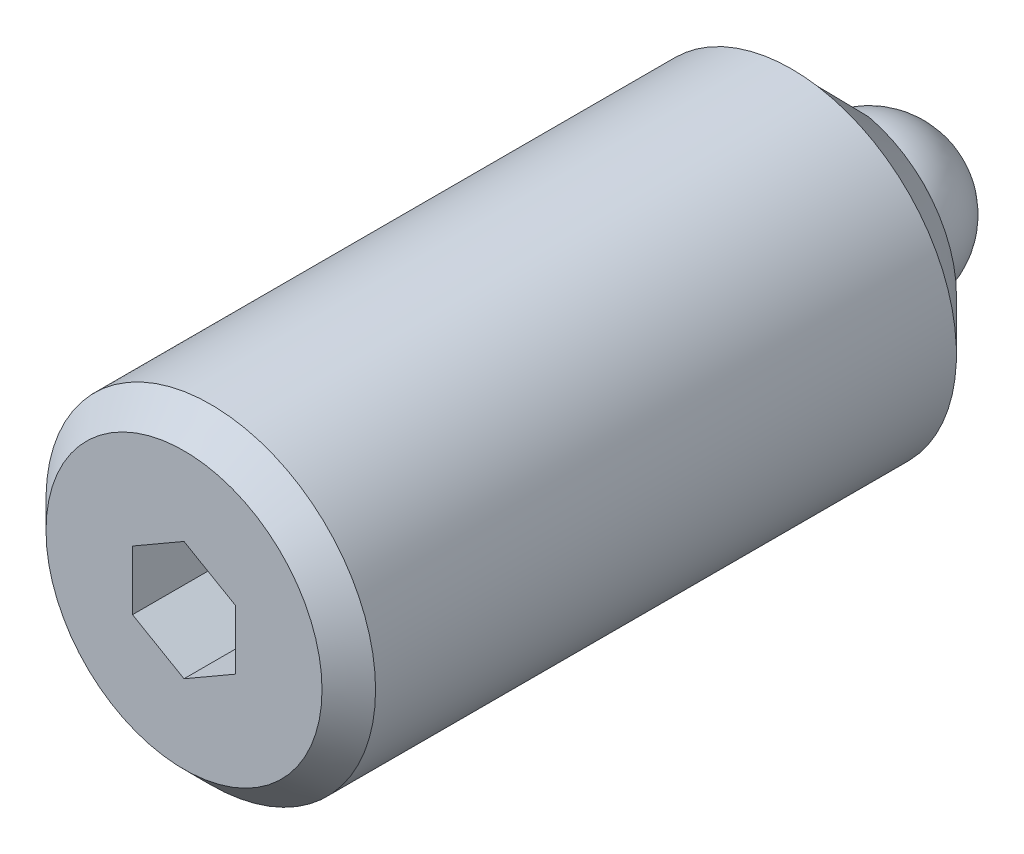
ISO-10303-21;
HEADER;
FILE_DESCRIPTION(('STEP AP214'),'2;1');
FILE_NAME('part.step','',(''),(''),'','','');
FILE_SCHEMA(('AUTOMOTIVE_DESIGN { 1 0 10303 214 1 1 1 1 }'));
ENDSEC;
DATA;
#1=APPLICATION_CONTEXT('core data for automotive mechanical design processes');
#2=APPLICATION_PROTOCOL_DEFINITION('international standard','automotive_design',2000,#1);
#3=PRODUCT_CONTEXT('',#1,'mechanical');
#4=PRODUCT('Part','Part','',(#3));
#5=PRODUCT_RELATED_PRODUCT_CATEGORY('part','',(#4));
#6=PRODUCT_DEFINITION_FORMATION('','',#4);
#7=PRODUCT_DEFINITION_CONTEXT('part definition',#1,'design');
#8=PRODUCT_DEFINITION('design','',#6,#7);
#9=PRODUCT_DEFINITION_SHAPE('','',#8);
#10=(LENGTH_UNIT() NAMED_UNIT(*) SI_UNIT(.MILLI.,.METRE.));
#11=(NAMED_UNIT(*) PLANE_ANGLE_UNIT() SI_UNIT($,.RADIAN.));
#12=(NAMED_UNIT(*) SI_UNIT($,.STERADIAN.) SOLID_ANGLE_UNIT());
#13=UNCERTAINTY_MEASURE_WITH_UNIT(LENGTH_MEASURE(1.E-05),#10,'distance_accuracy_value','');
#14=(GEOMETRIC_REPRESENTATION_CONTEXT(3) GLOBAL_UNCERTAINTY_ASSIGNED_CONTEXT((#13)) GLOBAL_UNIT_ASSIGNED_CONTEXT((#10,
#11,#12)) REPRESENTATION_CONTEXT('',''));
#15=CARTESIAN_POINT('',(0.,0.,0.));
#16=DIRECTION('',(0.,0.,1.));
#17=DIRECTION('',(1.,0.,0.));
#18=AXIS2_PLACEMENT_3D('',#15,#16,#17);
#19=CARTESIAN_POINT('',(0.,3.75,5.));
#20=DIRECTION('',(0.,0.,-1.));
#21=DIRECTION('',(-1.,0.,0.));
#22=AXIS2_PLACEMENT_3D('',#19,#20,#21);
#23=PLANE('',#22);
#24=DIRECTION('',(0.,-1.,0.));
#25=VECTOR('',#24,1.);
#26=CARTESIAN_POINT('',(1.25,-3.53553390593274,5.));
#27=LINE('',#26,#25);
#28=CARTESIAN_POINT('',(1.25,-3.53553390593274,5.));
#29=VERTEX_POINT('',#28);
#30=CARTESIAN_POINT('',(1.25,-5.35607132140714,5.));
#31=VERTEX_POINT('',#30);
#32=EDGE_CURVE('E130',#29,#31,#27,.T.);
#33=ORIENTED_EDGE('',*,*,#32,.F.);
#34=CARTESIAN_POINT('',(0.,0.,5.));
#35=DIRECTION('',(0.,0.,-1.));
#36=DIRECTION('',(-1.,0.,0.));
#37=AXIS2_PLACEMENT_3D('',#34,#35,#36);
#38=CIRCLE('',#37,3.75);
#39=CARTESIAN_POINT('',(1.25,3.53553390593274,5.));
#40=VERTEX_POINT('',#39);
#41=EDGE_CURVE('E219',#40,#29,#38,.T.);
#42=ORIENTED_EDGE('',*,*,#41,.F.);
#43=DIRECTION('',(0.,-1.,0.));
#44=VECTOR('',#43,1.);
#45=CARTESIAN_POINT('',(1.25,8.88295940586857,5.));
#46=LINE('',#45,#44);
#47=CARTESIAN_POINT('',(1.25,5.35607132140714,5.));
#48=VERTEX_POINT('',#47);
#49=EDGE_CURVE('E149',#48,#40,#46,.T.);
#50=ORIENTED_EDGE('',*,*,#49,.F.);
#51=CARTESIAN_POINT('',(0.,0.,5.));
#52=DIRECTION('',(0.,0.,-1.));
#53=DIRECTION('',(-1.,0.,0.));
#54=AXIS2_PLACEMENT_3D('',#51,#52,#53);
#55=CIRCLE('',#54,5.5);
#56=EDGE_CURVE('E228',#48,#31,#55,.T.);
#57=ORIENTED_EDGE('',*,*,#56,.T.);
#58=EDGE_LOOP('',(#33,#42,#50,#57));
#59=FACE_BOUND('',#58,.T.);
#60=ADVANCED_FACE('F14',(#59),#23,.T.);
#61=CARTESIAN_POINT('',(0.,0.,5.));
#62=DIRECTION('',(0.,0.,1.));
#63=DIRECTION('',(1.,0.,0.));
#64=AXIS2_PLACEMENT_3D('',#61,#62,#63);
#65=CONICAL_SURFACE('',#64,5.5,0.785398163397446);
#66=CARTESIAN_POINT('',(1.25,-0.636175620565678,0.902575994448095));
#67=CARTESIAN_POINT('',(1.25,-0.687765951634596,0.92601692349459));
#68=CARTESIAN_POINT('',(1.25,-0.738489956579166,0.951245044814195));
#69=CARTESIAN_POINT('',(1.25,-0.838371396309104,1.00451066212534));
#70=CARTESIAN_POINT('',(1.25,-0.887530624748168,1.03254477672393));
#71=CARTESIAN_POINT('',(1.25,-0.984401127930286,1.09061522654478));
#72=CARTESIAN_POINT('',(1.25,-1.03211685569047,1.12064423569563));
#73=CARTESIAN_POINT('',(1.25,-1.12650286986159,1.18233004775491));
#74=CARTESIAN_POINT('',(1.25,-1.17317279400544,1.21398740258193));
#75=CARTESIAN_POINT('',(1.25,-1.31143515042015,1.31052309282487));
#76=CARTESIAN_POINT('',(1.25,-1.40173495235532,1.37724748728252));
#77=CARTESIAN_POINT('',(1.25,-1.58002053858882,1.51387906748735));
#78=CARTESIAN_POINT('',(1.25,-1.66800357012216,1.58378979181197));
#79=CARTESIAN_POINT('',(1.25,-1.84105213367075,1.72474492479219));
#80=CARTESIAN_POINT('',(1.25,-1.92614113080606,1.79576062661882));
#81=CARTESIAN_POINT('',(1.25,-2.09508757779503,1.93924521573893));
#82=CARTESIAN_POINT('',(1.25,-2.17894495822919,2.01171418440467));
#83=CARTESIAN_POINT('',(1.25,-2.42917197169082,2.23071304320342));
#84=CARTESIAN_POINT('',(1.25,-2.59416714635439,2.37881048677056));
#85=CARTESIAN_POINT('',(1.25,-2.92196473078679,2.67740209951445));
#86=CARTESIAN_POINT('',(1.25,-3.08476708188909,2.82789633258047));
#87=CARTESIAN_POINT('',(1.25,-3.40891855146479,3.13040468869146));
#88=CARTESIAN_POINT('',(1.25,-3.57026782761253,3.28241864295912));
#89=CARTESIAN_POINT('',(1.25,-3.89271642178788,3.58816799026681));
#90=CARTESIAN_POINT('',(1.25,-4.05381129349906,3.74190806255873));
#91=CARTESIAN_POINT('',(1.25,-4.37529925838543,4.05012837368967));
#92=CARTESIAN_POINT('',(1.25,-4.5356923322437,4.2046086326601));
#93=CARTESIAN_POINT('',(1.25,-5.01605406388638,4.66879460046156));
#94=CARTESIAN_POINT('',(1.25,-5.33525577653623,4.97929370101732));
#95=CARTESIAN_POINT('',(1.25,-5.73904884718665,5.37357317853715));
#96=CARTESIAN_POINT('',(1.25,-5.82418979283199,5.45679264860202));
#97=CARTESIAN_POINT('',(1.25,-5.99431257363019,5.62323211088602));
#98=CARTESIAN_POINT('',(1.25,-6.07929448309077,5.7064520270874));
#99=CARTESIAN_POINT('',(1.25,-6.60154035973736,6.21827540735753));
#100=CARTESIAN_POINT('',(1.25,-7.03796289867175,6.64773729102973));
#101=CARTESIAN_POINT('',(1.25,-7.90982021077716,7.50766504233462));
#102=CARTESIAN_POINT('',(1.25,-8.34525497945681,7.93813091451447));
#103=CARTESIAN_POINT('',(1.25,-9.21804269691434,8.8022023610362));
#104=CARTESIAN_POINT('',(1.25,-9.65539201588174,9.23581160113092));
#105=CARTESIAN_POINT('',(1.25,-10.5296541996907,10.103462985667));
#106=CARTESIAN_POINT('',(1.25,-10.9665670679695,10.5375051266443));
#107=CARTESIAN_POINT('',(1.25,-11.403360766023,10.9716666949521));
#108=B_SPLINE_CURVE_WITH_KNOTS('',3,(#66,#67,#68,#69,#70,#71,#72,#73,#74,#75,#76,#77,#78,#79,
#80,#81,#82,#83,#84,#85,#86,#87,#88,#89,#90,#91,#92,#93,#94,#95,#96,#97,#98,#99,#100,#101,#102,
#103,#104,#105,#106,#107),.UNSPECIFIED.,.F.,.F.,(4,2,2,2,2,2,2,2,2,2,2,2,2,2,2,2,2,2,2,2,4),(0.,
0.169892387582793,0.339582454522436,0.5086805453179,0.677836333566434,1.01454437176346,
1.35163591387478,1.68410335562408,2.01658946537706,2.68167610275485,3.34678049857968,
4.01181183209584,4.67985691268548,5.34792026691,6.68383745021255,7.04100715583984,
7.39783661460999,9.2347105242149,11.0715927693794,12.9191915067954,14.7667755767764),.UNSPECIFIED.);
#109=CARTESIAN_POINT('',(1.25,-7.90174031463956,7.5));
#110=VERTEX_POINT('',#109);
#111=EDGE_CURVE('E9',#31,#110,#108,.T.);
#112=ORIENTED_EDGE('',*,*,#111,.F.);
#113=ORIENTED_EDGE('',*,*,#56,.F.);
#114=CARTESIAN_POINT('',(1.25,10.372012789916,9.94706414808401));
#115=CARTESIAN_POINT('',(1.25,9.97486132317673,9.55280019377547));
#116=CARTESIAN_POINT('',(1.25,9.57757942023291,9.1586670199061));
#117=CARTESIAN_POINT('',(1.25,8.78256551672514,8.37090183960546));
#118=CARTESIAN_POINT('',(1.25,8.38483354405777,7.9772698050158));
#119=CARTESIAN_POINT('',(1.25,7.58879350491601,7.19080865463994));
#120=CARTESIAN_POINT('',(1.25,7.1904856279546,6.79797934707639));
#121=CARTESIAN_POINT('',(1.25,6.39275328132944,6.01340650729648));
#122=CARTESIAN_POINT('',(1.25,5.99332874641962,5.62166304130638));
#123=CARTESIAN_POINT('',(1.25,5.4309374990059,5.07282441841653));
#124=CARTESIAN_POINT('',(1.25,5.26878371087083,4.91489651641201));
#125=CARTESIAN_POINT('',(1.25,4.94405474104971,4.59947789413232));
#126=CARTESIAN_POINT('',(1.25,4.78147956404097,4.44198716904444));
#127=CARTESIAN_POINT('',(1.25,4.45579189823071,4.12760969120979));
#128=CARTESIAN_POINT('',(1.25,4.29267949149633,3.97072285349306));
#129=CARTESIAN_POINT('',(1.25,3.96567849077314,3.65774610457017));
#130=CARTESIAN_POINT('',(1.25,3.80178986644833,3.50165622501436));
#131=CARTESIAN_POINT('',(1.25,3.47283655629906,3.19055994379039));
#132=CARTESIAN_POINT('',(1.25,3.30777134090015,3.03555410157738));
#133=CARTESIAN_POINT('',(1.25,2.97603308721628,2.72730018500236));
#134=CARTESIAN_POINT('',(1.25,2.80936022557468,2.57405192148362));
#135=CARTESIAN_POINT('',(1.25,2.55736222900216,2.34628380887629));
#136=CARTESIAN_POINT('',(1.25,2.47300785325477,2.27069121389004));
#137=CARTESIAN_POINT('',(1.25,2.30345394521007,2.12046703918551));
#138=CARTESIAN_POINT('',(1.25,2.21825445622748,2.04583541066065));
#139=CARTESIAN_POINT('',(1.25,2.04670450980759,1.89783478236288));
#140=CARTESIAN_POINT('',(1.25,1.96035362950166,1.82446627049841));
#141=CARTESIAN_POINT('',(1.25,1.82968211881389,1.71577400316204));
#142=CARTESIAN_POINT('',(1.25,1.78593024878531,1.67976694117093));
#143=CARTESIAN_POINT('',(1.25,1.69797281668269,1.60830728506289));
#144=CARTESIAN_POINT('',(1.25,1.6537672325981,1.57285471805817));
#145=CARTESIAN_POINT('',(1.25,1.60929974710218,1.53773052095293));
#146=B_SPLINE_CURVE_WITH_KNOTS('',3,(#114,#115,#116,#117,#118,#119,#120,#121,#122,#123,#124,
#125,#126,#127,#128,#129,#130,#131,#132,#133,#134,#135,#136,#137,#138,#139,#140,#141,#142,#143,
#144,#145),.UNSPECIFIED.,.F.,.F.,(4,2,2,2,2,2,2,2,2,2,2,2,2,2,2,4),(0.,1.67885747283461,
3.35761603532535,5.03591081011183,6.71430578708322,7.39336017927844,8.07240706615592,
8.75135463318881,9.43032895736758,10.109631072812,10.7888593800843,11.1286614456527,
11.4684461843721,11.8083593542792,11.9783453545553,12.1483396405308),.UNSPECIFIED.);
#147=CARTESIAN_POINT('',(1.25,7.90174031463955,7.5));
#148=VERTEX_POINT('',#147);
#149=EDGE_CURVE('E243',#148,#48,#146,.T.);
#150=ORIENTED_EDGE('',*,*,#149,.F.);
#151=CARTESIAN_POINT('',(0.,0.,7.5));
#152=DIRECTION('',(0.,0.,-1.));
#153=DIRECTION('',(-1.,0.,0.));
#154=AXIS2_PLACEMENT_3D('',#151,#152,#153);
#155=CIRCLE('',#154,8.);
#156=EDGE_CURVE('E231',#110,#148,#155,.F.);
#157=ORIENTED_EDGE('',*,*,#156,.F.);
#158=EDGE_LOOP('',(#112,#113,#150,#157));
#159=FACE_BOUND('',#158,.T.);
#160=ADVANCED_FACE('F304',(#159),#65,.T.);
#161=CARTESIAN_POINT('',(0.,8.,37.));
#162=DIRECTION('',(0.,0.,1.));
#163=DIRECTION('',(1.,0.,0.));
#164=AXIS2_PLACEMENT_3D('',#161,#162,#163);
#165=PLANE('',#164);
#166=CARTESIAN_POINT('',(0.,0.,37.));
#167=DIRECTION('',(0.,0.,1.));
#168=DIRECTION('',(1.,0.,0.));
#169=AXIS2_PLACEMENT_3D('',#166,#167,#168);
#170=CIRCLE('',#169,6.7);
#171=CARTESIAN_POINT('',(6.7,0.,37.));
#172=VERTEX_POINT('',#171);
#173=EDGE_CURVE('E224',#172,#172,#170,.T.);
#174=ORIENTED_EDGE('',*,*,#173,.T.);
#175=EDGE_LOOP('',(#174));
#176=FACE_BOUND('',#175,.T.);
#177=DIRECTION('',(0.866025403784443,-0.499999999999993,0.));
#178=VECTOR('',#177,1.);
#179=CARTESIAN_POINT('',(-2.5,-1.44337567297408,37.));
#180=LINE('',#179,#178);
#181=CARTESIAN_POINT('',(-2.5,-1.44337567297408,37.));
#182=VERTEX_POINT('',#181);
#183=CARTESIAN_POINT('',(0.,-2.88675134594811,37.));
#184=VERTEX_POINT('',#183);
#185=EDGE_CURVE('E181',#182,#184,#180,.T.);
#186=ORIENTED_EDGE('',*,*,#185,.F.);
#187=DIRECTION('',(0.,1.,0.));
#188=VECTOR('',#187,1.);
#189=CARTESIAN_POINT('',(-2.5,-1.44337567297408,37.));
#190=LINE('',#189,#188);
#191=CARTESIAN_POINT('',(-2.5,1.44337567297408,37.));
#192=VERTEX_POINT('',#191);
#193=EDGE_CURVE('E164',#182,#192,#190,.T.);
#194=ORIENTED_EDGE('',*,*,#193,.T.);
#195=DIRECTION('',(0.866025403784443,0.499999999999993,0.));
#196=VECTOR('',#195,1.);
#197=CARTESIAN_POINT('',(-2.5,1.44337567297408,37.));
#198=LINE('',#197,#196);
#199=CARTESIAN_POINT('',(0.,2.88675134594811,37.));
#200=VERTEX_POINT('',#199);
#201=EDGE_CURVE('E169',#192,#200,#198,.T.);
#202=ORIENTED_EDGE('',*,*,#201,.T.);
#203=DIRECTION('',(-0.866025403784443,0.499999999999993,0.));
#204=VECTOR('',#203,1.);
#205=CARTESIAN_POINT('',(2.5,1.44337567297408,37.));
#206=LINE('',#205,#204);
#207=CARTESIAN_POINT('',(2.5,1.44337567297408,37.));
#208=VERTEX_POINT('',#207);
#209=EDGE_CURVE('E172',#208,#200,#206,.T.);
#210=ORIENTED_EDGE('',*,*,#209,.F.);
#211=DIRECTION('',(0.,1.,0.));
#212=VECTOR('',#211,1.);
#213=CARTESIAN_POINT('',(2.5,-1.44337567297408,37.));
#214=LINE('',#213,#212);
#215=CARTESIAN_POINT('',(2.5,-1.44337567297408,37.));
#216=VERTEX_POINT('',#215);
#217=EDGE_CURVE('E175',#216,#208,#214,.T.);
#218=ORIENTED_EDGE('',*,*,#217,.F.);
#219=DIRECTION('',(-0.866025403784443,-0.499999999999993,0.));
#220=VECTOR('',#219,1.);
#221=CARTESIAN_POINT('',(2.5,-1.44337567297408,37.));
#222=LINE('',#221,#220);
#223=EDGE_CURVE('E178',#216,#184,#222,.T.);
#224=ORIENTED_EDGE('',*,*,#223,.T.);
#225=EDGE_LOOP('',(#186,#194,#202,#210,#218,#224));
#226=FACE_BOUND('',#225,.T.);
#227=ADVANCED_FACE('F301',(#176,#226),#165,.T.);
#228=CARTESIAN_POINT('',(0.,0.,3.75));
#229=DIRECTION('',(-1.,0.,0.));
#230=DIRECTION('',(0.,0.,1.));
#231=AXIS2_PLACEMENT_3D('',#228,#229,#230);
#232=SPHERICAL_SURFACE('',#231,3.75);
#233=CARTESIAN_POINT('',(0.,0.,3.75));
#234=DIRECTION('',(0.,0.,-1.));
#235=DIRECTION('',(-1.,0.,0.));
#236=AXIS2_PLACEMENT_3D('',#233,#234,#235);
#237=SPHERICAL_SURFACE('',#236,3.75);
#238=CARTESIAN_POINT('',(0.,0.,3.75));
#239=DIRECTION('',(0.,0.,-1.));
#240=DIRECTION('',(-1.,0.,0.));
#241=AXIS2_PLACEMENT_3D('',#238,#239,#240);
#242=CIRCLE('',#241,3.75);
#243=CARTESIAN_POINT('',(-3.75,0.,3.75));
#244=VERTEX_POINT('',#243);
#245=EDGE_CURVE('E215',#244,#244,#242,.T.);
#246=ORIENTED_EDGE('',*,*,#245,.T.);
#247=EDGE_LOOP('',(#246));
#248=FACE_BOUND('',#247,.T.);
#249=ADVANCED_FACE('F299',(#248),#237,.T.);
#250=CARTESIAN_POINT('',(0.,0.,-8.));
#251=DIRECTION('',(0.,0.,-1.));
#252=DIRECTION('',(-1.,0.,0.));
#253=AXIS2_PLACEMENT_3D('',#250,#251,#252);
#254=CYLINDRICAL_SURFACE('',#253,8.);
#255=CARTESIAN_POINT('',(-1.25,7.90174031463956,7.5));
#256=VERTEX_POINT('',#255);
#257=EDGE_CURVE('E232',#148,#256,#155,.F.);
#258=ORIENTED_EDGE('',*,*,#257,.T.);
#259=CARTESIAN_POINT('',(-1.25,-7.90174031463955,7.5));
#260=VERTEX_POINT('',#259);
#261=EDGE_CURVE('E236',#256,#260,#155,.F.);
#262=ORIENTED_EDGE('',*,*,#261,.T.);
#263=EDGE_CURVE('E127',#260,#110,#155,.F.);
#264=ORIENTED_EDGE('',*,*,#263,.T.);
#265=ORIENTED_EDGE('',*,*,#156,.T.);
#266=EDGE_LOOP('',(#258,#262,#264,#265));
#267=FACE_BOUND('',#266,.T.);
#268=CARTESIAN_POINT('',(0.,0.,35.7));
#269=DIRECTION('',(0.,0.,1.));
#270=DIRECTION('',(1.,0.,0.));
#271=AXIS2_PLACEMENT_3D('',#268,#269,#270);
#272=CIRCLE('',#271,8.);
#273=CARTESIAN_POINT('',(8.,0.,35.7));
#274=VERTEX_POINT('',#273);
#275=EDGE_CURVE('E221',#274,#274,#272,.F.);
#276=ORIENTED_EDGE('',*,*,#275,.T.);
#277=EDGE_LOOP('',(#276));
#278=FACE_BOUND('',#277,.T.);
#279=ADVANCED_FACE('F295',(#267,#278),#254,.T.);
#280=DIRECTION('',(0.,1.,0.));
#281=VECTOR('',#280,1.);
#282=CARTESIAN_POINT('',(-1.25,-3.53553390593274,5.));
#283=LINE('',#282,#281);
#284=CARTESIAN_POINT('',(-1.25,-5.35607132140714,5.));
#285=VERTEX_POINT('',#284);
#286=CARTESIAN_POINT('',(-1.25,-3.53553390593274,5.));
#287=VERTEX_POINT('',#286);
#288=EDGE_CURVE('E136',#285,#287,#283,.T.);
#289=ORIENTED_EDGE('',*,*,#288,.F.);
#290=CARTESIAN_POINT('',(-1.25,5.35607132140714,5.));
#291=VERTEX_POINT('',#290);
#292=EDGE_CURVE('E227',#285,#291,#55,.T.);
#293=ORIENTED_EDGE('',*,*,#292,.T.);
#294=DIRECTION('',(0.,1.,0.));
#295=VECTOR('',#294,1.);
#296=CARTESIAN_POINT('',(-1.25,8.88295940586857,5.));
#297=LINE('',#296,#295);
#298=CARTESIAN_POINT('',(-1.25,3.53553390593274,5.));
#299=VERTEX_POINT('',#298);
#300=EDGE_CURVE('E154',#299,#291,#297,.T.);
#301=ORIENTED_EDGE('',*,*,#300,.F.);
#302=EDGE_CURVE('E218',#287,#299,#38,.T.);
#303=ORIENTED_EDGE('',*,*,#302,.F.);
#304=EDGE_LOOP('',(#289,#293,#301,#303));
#305=FACE_BOUND('',#304,.T.);
#306=ADVANCED_FACE('F292',(#305),#23,.T.);
#307=CARTESIAN_POINT('',(0.,0.,-8.));
#308=DIRECTION('',(0.,0.,-1.));
#309=DIRECTION('',(-1.,0.,0.));
#310=AXIS2_PLACEMENT_3D('',#307,#308,#309);
#311=CYLINDRICAL_SURFACE('',#310,3.75);
#312=ORIENTED_EDGE('',*,*,#41,.T.);
#313=DIRECTION('',(0.,0.,-1.));
#314=VECTOR('',#313,1.);
#315=CARTESIAN_POINT('',(1.25,-3.53553390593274,7.5));
#316=LINE('',#315,#314);
#317=CARTESIAN_POINT('',(1.25,-3.53553390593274,7.5));
#318=VERTEX_POINT('',#317);
#319=EDGE_CURVE('E139',#318,#29,#316,.T.);
#320=ORIENTED_EDGE('',*,*,#319,.F.);
#321=CARTESIAN_POINT('',(0.,0.,7.5));
#322=DIRECTION('',(0.,0.,1.));
#323=DIRECTION('',(-1.,0.,0.));
#324=AXIS2_PLACEMENT_3D('',#321,#322,#323);
#325=CIRCLE('',#324,3.75);
#326=CARTESIAN_POINT('',(-1.25,-3.53553390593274,7.5));
#327=VERTEX_POINT('',#326);
#328=EDGE_CURVE('E125',#327,#318,#325,.T.);
#329=ORIENTED_EDGE('',*,*,#328,.F.);
#330=DIRECTION('',(0.,0.,-1.));
#331=VECTOR('',#330,1.);
#332=CARTESIAN_POINT('',(-1.25,-3.53553390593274,7.5));
#333=LINE('',#332,#331);
#334=EDGE_CURVE('E133',#327,#287,#333,.T.);
#335=ORIENTED_EDGE('',*,*,#334,.T.);
#336=ORIENTED_EDGE('',*,*,#302,.T.);
#337=DIRECTION('',(0.,0.,-1.));
#338=VECTOR('',#337,1.);
#339=CARTESIAN_POINT('',(-1.25,3.53553390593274,7.5));
#340=LINE('',#339,#338);
#341=CARTESIAN_POINT('',(-1.25,3.53553390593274,7.5));
#342=VERTEX_POINT('',#341);
#343=EDGE_CURVE('E161',#342,#299,#340,.T.);
#344=ORIENTED_EDGE('',*,*,#343,.F.);
#345=CARTESIAN_POINT('',(0.,0.,7.5));
#346=DIRECTION('',(0.,0.,1.));
#347=DIRECTION('',(-1.,0.,0.));
#348=AXIS2_PLACEMENT_3D('',#345,#346,#347);
#349=CIRCLE('',#348,3.75);
#350=CARTESIAN_POINT('',(1.25,3.53553390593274,7.5));
#351=VERTEX_POINT('',#350);
#352=EDGE_CURVE('E153',#351,#342,#349,.T.);
#353=ORIENTED_EDGE('',*,*,#352,.F.);
#354=DIRECTION('',(0.,0.,-1.));
#355=VECTOR('',#354,1.);
#356=CARTESIAN_POINT('',(1.25,3.53553390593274,7.5));
#357=LINE('',#356,#355);
#358=EDGE_CURVE('E157',#351,#40,#357,.T.);
#359=ORIENTED_EDGE('',*,*,#358,.T.);
#360=EDGE_LOOP('',(#312,#320,#329,#335,#336,#344,#353,#359));
#361=FACE_BOUND('',#360,.T.);
#362=ORIENTED_EDGE('',*,*,#245,.F.);
#363=EDGE_LOOP('',(#362));
#364=FACE_BOUND('',#363,.T.);
#365=ADVANCED_FACE('F142',(#361,#364),#311,.T.);
#366=CARTESIAN_POINT('',(-2.5,-1.44337567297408,31.));
#367=DIRECTION('',(1.,0.,0.));
#368=DIRECTION('',(0.,0.,-1.));
#369=AXIS2_PLACEMENT_3D('',#366,#367,#368);
#370=PLANE('',#369);
#371=DIRECTION('',(0.,0.,1.));
#372=VECTOR('',#371,1.);
#373=CARTESIAN_POINT('',(-2.5,1.44337567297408,31.));
#374=LINE('',#373,#372);
#375=CARTESIAN_POINT('',(-2.5,1.44337567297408,31.));
#376=VERTEX_POINT('',#375);
#377=EDGE_CURVE('E213',#376,#192,#374,.T.);
#378=ORIENTED_EDGE('',*,*,#377,.T.);
#379=ORIENTED_EDGE('',*,*,#193,.F.);
#380=DIRECTION('',(0.,0.,1.));
#381=VECTOR('',#380,1.);
#382=CARTESIAN_POINT('',(-2.5,-1.44337567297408,31.));
#383=LINE('',#382,#381);
#384=CARTESIAN_POINT('',(-2.5,-1.44337567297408,31.));
#385=VERTEX_POINT('',#384);
#386=EDGE_CURVE('E202',#385,#182,#383,.T.);
#387=ORIENTED_EDGE('',*,*,#386,.F.);
#388=DIRECTION('',(0.,1.,0.));
#389=VECTOR('',#388,1.);
#390=CARTESIAN_POINT('',(-2.5,-1.44337567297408,31.));
#391=LINE('',#390,#389);
#392=EDGE_CURVE('E184',#385,#376,#391,.T.);
#393=ORIENTED_EDGE('',*,*,#392,.T.);
#394=EDGE_LOOP('',(#378,#379,#387,#393));
#395=FACE_BOUND('',#394,.T.);
#396=ADVANCED_FACE('F268',(#395),#370,.T.);
#397=CARTESIAN_POINT('',(-2.5,1.44337567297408,31.));
#398=DIRECTION('',(0.499999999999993,-0.866025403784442,0.));
#399=DIRECTION('',(0.866025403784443,0.499999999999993,0.));
#400=AXIS2_PLACEMENT_3D('',#397,#398,#399);
#401=PLANE('',#400);
#402=DIRECTION('',(0.,0.,1.));
#403=VECTOR('',#402,1.);
#404=CARTESIAN_POINT('',(0.,2.88675134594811,31.));
#405=LINE('',#404,#403);
#406=CARTESIAN_POINT('',(0.,2.88675134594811,31.));
#407=VERTEX_POINT('',#406);
#408=EDGE_CURVE('E211',#407,#200,#405,.T.);
#409=ORIENTED_EDGE('',*,*,#408,.T.);
#410=ORIENTED_EDGE('',*,*,#201,.F.);
#411=ORIENTED_EDGE('',*,*,#377,.F.);
#412=DIRECTION('',(0.866025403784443,0.499999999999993,0.));
#413=VECTOR('',#412,1.);
#414=CARTESIAN_POINT('',(-2.5,1.44337567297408,31.));
#415=LINE('',#414,#413);
#416=EDGE_CURVE('E187',#376,#407,#415,.T.);
#417=ORIENTED_EDGE('',*,*,#416,.T.);
#418=EDGE_LOOP('',(#409,#410,#411,#417));
#419=FACE_BOUND('',#418,.T.);
#420=ADVANCED_FACE('F271',(#419),#401,.T.);
#421=CARTESIAN_POINT('',(2.5,1.44337567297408,31.));
#422=DIRECTION('',(0.499999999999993,0.866025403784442,0.));
#423=DIRECTION('',(-0.866025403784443,0.499999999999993,0.));
#424=AXIS2_PLACEMENT_3D('',#421,#422,#423);
#425=PLANE('',#424);
#426=DIRECTION('',(0.,0.,1.));
#427=VECTOR('',#426,1.);
#428=CARTESIAN_POINT('',(2.5,1.44337567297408,31.));
#429=LINE('',#428,#427);
#430=CARTESIAN_POINT('',(2.5,1.44337567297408,31.));
#431=VERTEX_POINT('',#430);
#432=EDGE_CURVE('E209',#431,#208,#429,.T.);
#433=ORIENTED_EDGE('',*,*,#432,.T.);
#434=ORIENTED_EDGE('',*,*,#209,.T.);
#435=ORIENTED_EDGE('',*,*,#408,.F.);
#436=DIRECTION('',(-0.866025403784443,0.499999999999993,0.));
#437=VECTOR('',#436,1.);
#438=CARTESIAN_POINT('',(2.5,1.44337567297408,31.));
#439=LINE('',#438,#437);
#440=EDGE_CURVE('E190',#431,#407,#439,.T.);
#441=ORIENTED_EDGE('',*,*,#440,.F.);
#442=EDGE_LOOP('',(#433,#434,#435,#441));
#443=FACE_BOUND('',#442,.T.);
#444=ADVANCED_FACE('F282',(#443),#425,.F.);
#445=CARTESIAN_POINT('',(2.5,-1.44337567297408,31.));
#446=DIRECTION('',(1.,0.,0.));
#447=DIRECTION('',(0.,0.,-1.));
#448=AXIS2_PLACEMENT_3D('',#445,#446,#447);
#449=PLANE('',#448);
#450=DIRECTION('',(0.,0.,1.));
#451=VECTOR('',#450,1.);
#452=CARTESIAN_POINT('',(2.5,-1.44337567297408,31.));
#453=LINE('',#452,#451);
#454=CARTESIAN_POINT('',(2.5,-1.44337567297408,31.));
#455=VERTEX_POINT('',#454);
#456=EDGE_CURVE('E207',#455,#216,#453,.T.);
#457=ORIENTED_EDGE('',*,*,#456,.T.);
#458=ORIENTED_EDGE('',*,*,#217,.T.);
#459=ORIENTED_EDGE('',*,*,#432,.F.);
#460=DIRECTION('',(0.,1.,0.));
#461=VECTOR('',#460,1.);
#462=CARTESIAN_POINT('',(2.5,-1.44337567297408,31.));
#463=LINE('',#462,#461);
#464=EDGE_CURVE('E193',#455,#431,#463,.T.);
#465=ORIENTED_EDGE('',*,*,#464,.F.);
#466=EDGE_LOOP('',(#457,#458,#459,#465));
#467=FACE_BOUND('',#466,.T.);
#468=ADVANCED_FACE('F278',(#467),#449,.F.);
#469=CARTESIAN_POINT('',(2.5,-1.44337567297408,31.));
#470=DIRECTION('',(-0.499999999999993,0.866025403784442,0.));
#471=DIRECTION('',(-0.866025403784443,-0.499999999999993,0.));
#472=AXIS2_PLACEMENT_3D('',#469,#470,#471);
#473=PLANE('',#472);
#474=DIRECTION('',(0.,0.,1.));
#475=VECTOR('',#474,1.);
#476=CARTESIAN_POINT('',(0.,-2.88675134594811,31.));
#477=LINE('',#476,#475);
#478=CARTESIAN_POINT('',(0.,-2.88675134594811,31.));
#479=VERTEX_POINT('',#478);
#480=EDGE_CURVE('E205',#479,#184,#477,.T.);
#481=ORIENTED_EDGE('',*,*,#480,.T.);
#482=ORIENTED_EDGE('',*,*,#223,.F.);
#483=ORIENTED_EDGE('',*,*,#456,.F.);
#484=DIRECTION('',(-0.866025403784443,-0.499999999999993,0.));
#485=VECTOR('',#484,1.);
#486=CARTESIAN_POINT('',(2.5,-1.44337567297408,31.));
#487=LINE('',#486,#485);
#488=EDGE_CURVE('E196',#455,#479,#487,.T.);
#489=ORIENTED_EDGE('',*,*,#488,.T.);
#490=EDGE_LOOP('',(#481,#482,#483,#489));
#491=FACE_BOUND('',#490,.T.);
#492=ADVANCED_FACE('F267',(#491),#473,.T.);
#493=CARTESIAN_POINT('',(-2.5,-1.44337567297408,31.));
#494=DIRECTION('',(-0.499999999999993,-0.866025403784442,0.));
#495=DIRECTION('',(0.866025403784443,-0.499999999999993,0.));
#496=AXIS2_PLACEMENT_3D('',#493,#494,#495);
#497=PLANE('',#496);
#498=DIRECTION('',(0.866025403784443,-0.499999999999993,0.));
#499=VECTOR('',#498,1.);
#500=CARTESIAN_POINT('',(-2.5,-1.44337567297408,31.));
#501=LINE('',#500,#499);
#502=EDGE_CURVE('E199',#385,#479,#501,.T.);
#503=ORIENTED_EDGE('',*,*,#502,.F.);
#504=ORIENTED_EDGE('',*,*,#386,.T.);
#505=ORIENTED_EDGE('',*,*,#185,.T.);
#506=ORIENTED_EDGE('',*,*,#480,.F.);
#507=EDGE_LOOP('',(#503,#504,#505,#506));
#508=FACE_BOUND('',#507,.T.);
#509=ADVANCED_FACE('F265',(#508),#497,.F.);
#510=CARTESIAN_POINT('',(-2.5,1.44337567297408,31.));
#511=DIRECTION('',(0.,0.,-1.));
#512=DIRECTION('',(-1.,0.,0.));
#513=AXIS2_PLACEMENT_3D('',#510,#511,#512);
#514=PLANE('',#513);
#515=ORIENTED_EDGE('',*,*,#392,.F.);
#516=ORIENTED_EDGE('',*,*,#502,.T.);
#517=ORIENTED_EDGE('',*,*,#488,.F.);
#518=ORIENTED_EDGE('',*,*,#464,.T.);
#519=ORIENTED_EDGE('',*,*,#440,.T.);
#520=ORIENTED_EDGE('',*,*,#416,.F.);
#521=EDGE_LOOP('',(#515,#516,#517,#518,#519,#520));
#522=FACE_BOUND('',#521,.T.);
#523=ADVANCED_FACE('F261',(#522),#514,.F.);
#524=CARTESIAN_POINT('',(0.,0.,35.7));
#525=DIRECTION('',(0.,0.,-1.));
#526=DIRECTION('',(-1.,0.,0.));
#527=AXIS2_PLACEMENT_3D('',#524,#525,#526);
#528=CONICAL_SURFACE('',#527,8.,0.785398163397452);
#529=ORIENTED_EDGE('',*,*,#173,.F.);
#530=EDGE_LOOP('',(#529));
#531=FACE_BOUND('',#530,.T.);
#532=ORIENTED_EDGE('',*,*,#275,.F.);
#533=EDGE_LOOP('',(#532));
#534=FACE_BOUND('',#533,.T.);
#535=ADVANCED_FACE('F264',(#531,#534),#528,.T.);
#536=CARTESIAN_POINT('',(-1.25,-11.403360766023,10.9716666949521));
#537=CARTESIAN_POINT('',(-1.25,-10.9675954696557,10.5385280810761));
#538=CARTESIAN_POINT('',(-1.25,-10.5317121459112,10.1055077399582));
#539=CARTESIAN_POINT('',(-1.25,-9.65964074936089,9.24002572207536));
#540=CARTESIAN_POINT('',(-1.25,-9.2234528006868,8.80756392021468));
#541=CARTESIAN_POINT('',(-1.25,-8.56887397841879,8.15951407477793));
#542=CARTESIAN_POINT('',(-1.25,-8.35071743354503,7.94368937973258));
#543=CARTESIAN_POINT('',(-1.25,-7.91420631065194,7.51224403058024));
#544=CARTESIAN_POINT('',(-1.25,-7.69585173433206,7.2966233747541));
#545=CARTESIAN_POINT('',(-1.25,-7.25882908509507,6.86558221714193));
#546=CARTESIAN_POINT('',(-1.25,-7.04016094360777,6.65016178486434));
#547=CARTESIAN_POINT('',(-1.25,-6.60248432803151,6.21965328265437));
#548=CARTESIAN_POINT('',(-1.25,-6.38347584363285,6.00456522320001));
#549=CARTESIAN_POINT('',(-1.25,-5.94465007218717,5.5744923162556));
#550=CARTESIAN_POINT('',(-1.25,-5.7248320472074,5.35950822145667));
#551=CARTESIAN_POINT('',(-1.25,-5.28459803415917,4.93020172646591));
#552=CARTESIAN_POINT('',(-1.25,-5.06418211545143,4.71587925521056));
#553=CARTESIAN_POINT('',(-1.25,-4.62264108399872,4.28834703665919));
#554=CARTESIAN_POINT('',(-1.25,-4.40151674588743,4.07513648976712));
#555=CARTESIAN_POINT('',(-1.25,-3.95782809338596,3.6500366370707));
#556=CARTESIAN_POINT('',(-1.25,-3.73526323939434,3.43814789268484));
#557=CARTESIAN_POINT('',(-1.25,-3.39941617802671,3.12175940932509));
#558=CARTESIAN_POINT('',(-1.25,-3.28696329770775,3.01638002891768));
#559=CARTESIAN_POINT('',(-1.25,-3.06132548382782,2.80643247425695));
#560=CARTESIAN_POINT('',(-1.25,-2.94814063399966,2.70186421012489));
#561=CARTESIAN_POINT('',(-1.25,-2.72091675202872,2.4939579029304));
#562=CARTESIAN_POINT('',(-1.25,-2.6068790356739,2.39061842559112));
#563=CARTESIAN_POINT('',(-1.25,-2.37735885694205,2.18545791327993));
#564=CARTESIAN_POINT('',(-1.25,-2.26187581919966,2.08363752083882));
#565=CARTESIAN_POINT('',(-1.25,-2.02834477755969,1.88184254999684));
#566=CARTESIAN_POINT('',(-1.25,-1.9102873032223,1.78187883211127));
#567=CARTESIAN_POINT('',(-1.25,-1.73094059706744,1.63483126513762));
#568=CARTESIAN_POINT('',(-1.25,-1.67081832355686,1.58632661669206));
#569=CARTESIAN_POINT('',(-1.25,-1.54957518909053,1.49055140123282));
#570=CARTESIAN_POINT('',(-1.25,-1.48845412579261,1.44328108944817));
#571=CARTESIAN_POINT('',(-1.25,-1.36463444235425,1.35014932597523));
#572=CARTESIAN_POINT('',(-1.25,-1.30192919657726,1.30429663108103));
#573=CARTESIAN_POINT('',(-1.25,-1.1749306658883,1.21491276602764));
#574=CARTESIAN_POINT('',(-1.25,-1.11063832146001,1.17138026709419));
#575=CARTESIAN_POINT('',(-1.25,-0.979682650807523,1.08736821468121));
#576=CARTESIAN_POINT('',(-1.25,-0.913010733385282,1.04690181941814));
#577=CARTESIAN_POINT('',(-1.25,-0.81092934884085,0.989736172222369));
#578=CARTESIAN_POINT('',(-1.25,-0.776521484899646,0.971253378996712));
#579=CARTESIAN_POINT('',(-1.25,-0.706938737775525,0.935747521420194));
#580=CARTESIAN_POINT('',(-1.25,-0.671763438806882,0.918725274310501));
#581=CARTESIAN_POINT('',(-1.25,-0.636175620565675,0.902575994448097));
#582=B_SPLINE_CURVE_WITH_KNOTS('',3,(#536,#537,#538,#539,#540,#541,#542,#543,#544,#545,#546,
#547,#548,#549,#550,#551,#552,#553,#554,#555,#556,#557,#558,#559,#560,#561,#562,#563,#564,#565,
#566,#567,#568,#569,#570,#571,#572,#573,#574,#575,#576,#577,#578,#579,#580,#581),.UNSPECIFIED.,
.F.,.F.,(4,2,2,2,2,2,2,2,2,2,2,2,2,2,2,2,2,2,2,2,2,2,4),(0.,1.84323247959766,3.68593341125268,
4.60655982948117,5.52717842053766,6.44804484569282,7.36893973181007,8.29135048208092,
9.21365844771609,10.1351717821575,11.0570529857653,11.5193857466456,11.9816665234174,
12.443340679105,12.9052048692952,13.369229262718,13.6009638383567,13.8327459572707,
14.065751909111,14.2986229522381,14.5324425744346,14.6495849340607,14.7667924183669),.UNSPECIFIED.);
#583=EDGE_CURVE('E28',#260,#285,#582,.T.);
#584=ORIENTED_EDGE('',*,*,#583,.F.);
#585=ORIENTED_EDGE('',*,*,#261,.F.);
#586=CARTESIAN_POINT('',(-1.25,1.60929974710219,1.53773052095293));
#587=CARTESIAN_POINT('',(-1.25,1.68753414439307,1.59957125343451));
#588=CARTESIAN_POINT('',(-1.25,1.76498868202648,1.66237900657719));
#589=CARTESIAN_POINT('',(-1.25,1.91864343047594,1.78949088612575));
#590=CARTESIAN_POINT('',(-1.25,1.99484382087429,1.85379479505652));
#591=CARTESIAN_POINT('',(-1.25,2.14629202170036,1.98345711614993));
#592=CARTESIAN_POINT('',(-1.25,2.22154015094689,2.04881515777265));
#593=CARTESIAN_POINT('',(-1.25,2.37131181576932,2.18036156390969));
#594=CARTESIAN_POINT('',(-1.25,2.44583532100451,2.24654996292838));
#595=CARTESIAN_POINT('',(-1.25,2.66847363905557,2.44599253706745));
#596=CARTESIAN_POINT('',(-1.25,2.8157381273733,2.58019495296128));
#597=CARTESIAN_POINT('',(-1.25,3.10880086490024,2.85021423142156));
#598=CARTESIAN_POINT('',(-1.25,3.25459895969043,2.98603126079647));
#599=CARTESIAN_POINT('',(-1.25,3.58471817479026,3.2958685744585));
#600=CARTESIAN_POINT('',(-1.25,3.76872327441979,3.47022524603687));
#601=CARTESIAN_POINT('',(-1.25,4.13564057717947,3.8200683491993));
#602=CARTESIAN_POINT('',(-1.25,4.31855282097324,3.99555473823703));
#603=CARTESIAN_POINT('',(-1.25,4.68368327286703,4.34737064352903));
#604=CARTESIAN_POINT('',(-1.25,4.86590122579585,4.52370042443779));
#605=CARTESIAN_POINT('',(-1.25,5.22979007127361,4.87692372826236));
#606=CARTESIAN_POINT('',(-1.25,5.41146096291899,5.0538172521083));
#607=CARTESIAN_POINT('',(-1.25,5.99353763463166,5.62186685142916));
#608=CARTESIAN_POINT('',(-1.25,6.39317000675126,6.01381514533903));
#609=CARTESIAN_POINT('',(-1.25,7.1913406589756,6.79882146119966));
#610=CARTESIAN_POINT('',(-1.25,7.58987894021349,7.1918794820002));
#611=CARTESIAN_POINT('',(-1.25,8.38594159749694,7.97836609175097));
#612=CARTESIAN_POINT('',(-1.25,8.78346653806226,8.37179410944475));
#613=CARTESIAN_POINT('',(-1.25,9.57804202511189,9.15912590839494));
#614=CARTESIAN_POINT('',(-1.25,9.97509257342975,9.55302968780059));
#615=CARTESIAN_POINT('',(-1.25,10.372012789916,9.94706414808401));
#616=B_SPLINE_CURVE_WITH_KNOTS('',3,(#586,#587,#588,#589,#590,#591,#592,#593,#594,#595,#596,
#597,#598,#599,#600,#601,#602,#603,#604,#605,#606,#607,#608,#609,#610,#611,#612,#613,#614,#615),
.UNSPECIFIED.,.F.,.F.,(4,2,2,2,2,2,2,2,2,2,2,2,2,2,4),(0.,0.299147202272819,0.59825119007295,
0.897252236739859,1.19626574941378,1.79396798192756,2.39173251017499,3.15219966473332,
3.91263834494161,4.67333376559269,5.43403044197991,7.11330087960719,8.79256957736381,
10.4704561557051,12.1483362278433),.UNSPECIFIED.);
#617=EDGE_CURVE('E235',#291,#256,#616,.T.);
#618=ORIENTED_EDGE('',*,*,#617,.F.);
#619=ORIENTED_EDGE('',*,*,#292,.F.);
#620=EDGE_LOOP('',(#584,#585,#618,#619));
#621=FACE_BOUND('',#620,.T.);
#622=ADVANCED_FACE('F16',(#621),#65,.T.);
#623=CARTESIAN_POINT('',(1.25,8.88295940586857,7.5));
#624=DIRECTION('',(1.,0.,0.));
#625=DIRECTION('',(0.,1.,0.));
#626=AXIS2_PLACEMENT_3D('',#623,#624,#625);
#627=PLANE('',#626);
#628=ORIENTED_EDGE('',*,*,#149,.T.);
#629=ORIENTED_EDGE('',*,*,#49,.T.);
#630=ORIENTED_EDGE('',*,*,#358,.F.);
#631=DIRECTION('',(0.,-1.,0.));
#632=VECTOR('',#631,1.);
#633=CARTESIAN_POINT('',(1.25,8.88295940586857,7.5));
#634=LINE('',#633,#632);
#635=EDGE_CURVE('E151',#148,#351,#634,.T.);
#636=ORIENTED_EDGE('',*,*,#635,.F.);
#637=EDGE_LOOP('',(#628,#629,#630,#636));
#638=FACE_BOUND('',#637,.T.);
#639=ADVANCED_FACE('F254',(#638),#627,.F.);
#640=CARTESIAN_POINT('',(-1.25,8.88295940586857,7.5));
#641=DIRECTION('',(-1.,0.,0.));
#642=DIRECTION('',(0.,-1.,0.));
#643=AXIS2_PLACEMENT_3D('',#640,#641,#642);
#644=PLANE('',#643);
#645=ORIENTED_EDGE('',*,*,#617,.T.);
#646=DIRECTION('',(0.,1.,0.));
#647=VECTOR('',#646,1.);
#648=CARTESIAN_POINT('',(-1.25,8.88295940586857,7.5));
#649=LINE('',#648,#647);
#650=EDGE_CURVE('E42',#342,#256,#649,.T.);
#651=ORIENTED_EDGE('',*,*,#650,.F.);
#652=ORIENTED_EDGE('',*,*,#343,.T.);
#653=ORIENTED_EDGE('',*,*,#300,.T.);
#654=EDGE_LOOP('',(#645,#651,#652,#653));
#655=FACE_BOUND('',#654,.T.);
#656=ADVANCED_FACE('F249',(#655),#644,.F.);
#657=CARTESIAN_POINT('',(0.,0.,7.5));
#658=DIRECTION('',(0.,0.,-1.));
#659=DIRECTION('',(-1.,0.,0.));
#660=AXIS2_PLACEMENT_3D('',#657,#658,#659);
#661=PLANE('',#660);
#662=ORIENTED_EDGE('',*,*,#635,.T.);
#663=ORIENTED_EDGE('',*,*,#352,.T.);
#664=ORIENTED_EDGE('',*,*,#650,.T.);
#665=ORIENTED_EDGE('',*,*,#257,.F.);
#666=EDGE_LOOP('',(#662,#663,#664,#665));
#667=FACE_BOUND('',#666,.T.);
#668=ADVANCED_FACE('F253',(#667),#661,.T.);
#669=CARTESIAN_POINT('',(1.25,-3.53553390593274,7.5));
#670=DIRECTION('',(1.,0.,0.));
#671=DIRECTION('',(0.,1.,0.));
#672=AXIS2_PLACEMENT_3D('',#669,#670,#671);
#673=PLANE('',#672);
#674=ORIENTED_EDGE('',*,*,#111,.T.);
#675=DIRECTION('',(0.,-1.,0.));
#676=VECTOR('',#675,1.);
#677=CARTESIAN_POINT('',(1.25,-3.53553390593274,7.5));
#678=LINE('',#677,#676);
#679=EDGE_CURVE('E35',#318,#110,#678,.T.);
#680=ORIENTED_EDGE('',*,*,#679,.F.);
#681=ORIENTED_EDGE('',*,*,#319,.T.);
#682=ORIENTED_EDGE('',*,*,#32,.T.);
#683=EDGE_LOOP('',(#674,#680,#681,#682));
#684=FACE_BOUND('',#683,.T.);
#685=ADVANCED_FACE('F336',(#684),#673,.F.);
#686=CARTESIAN_POINT('',(-1.25,-3.53553390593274,7.5));
#687=DIRECTION('',(-1.,0.,0.));
#688=DIRECTION('',(0.,-1.,0.));
#689=AXIS2_PLACEMENT_3D('',#686,#687,#688);
#690=PLANE('',#689);
#691=ORIENTED_EDGE('',*,*,#583,.T.);
#692=ORIENTED_EDGE('',*,*,#288,.T.);
#693=ORIENTED_EDGE('',*,*,#334,.F.);
#694=DIRECTION('',(0.,1.,0.));
#695=VECTOR('',#694,1.);
#696=CARTESIAN_POINT('',(-1.25,-3.53553390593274,7.5));
#697=LINE('',#696,#695);
#698=EDGE_CURVE('E121',#260,#327,#697,.T.);
#699=ORIENTED_EDGE('',*,*,#698,.F.);
#700=EDGE_LOOP('',(#691,#692,#693,#699));
#701=FACE_BOUND('',#700,.T.);
#702=ADVANCED_FACE('F134',(#701),#690,.F.);
#703=CARTESIAN_POINT('',(0.,0.,7.5));
#704=DIRECTION('',(0.,0.,-1.));
#705=DIRECTION('',(-1.,0.,0.));
#706=AXIS2_PLACEMENT_3D('',#703,#704,#705);
#707=PLANE('',#706);
#708=ORIENTED_EDGE('',*,*,#698,.T.);
#709=ORIENTED_EDGE('',*,*,#328,.T.);
#710=ORIENTED_EDGE('',*,*,#679,.T.);
#711=ORIENTED_EDGE('',*,*,#263,.F.);
#712=EDGE_LOOP('',(#708,#709,#710,#711));
#713=FACE_BOUND('',#712,.T.);
#714=ADVANCED_FACE('F123',(#713),#707,.T.);
#715=CLOSED_SHELL('',(#60,#160,#227,#249,#279,#306,#365,#396,#420,#444,#468,#492,#509,#523,#535,
#622,#639,#656,#668,#685,#702,#714));
#716=MANIFOLD_SOLID_BREP('B1',#715);
#717=ADVANCED_BREP_SHAPE_REPRESENTATION('',(#18,#716),#14);
#718=SHAPE_DEFINITION_REPRESENTATION(#9,#717);
ENDSEC;
END-ISO-10303-21;
